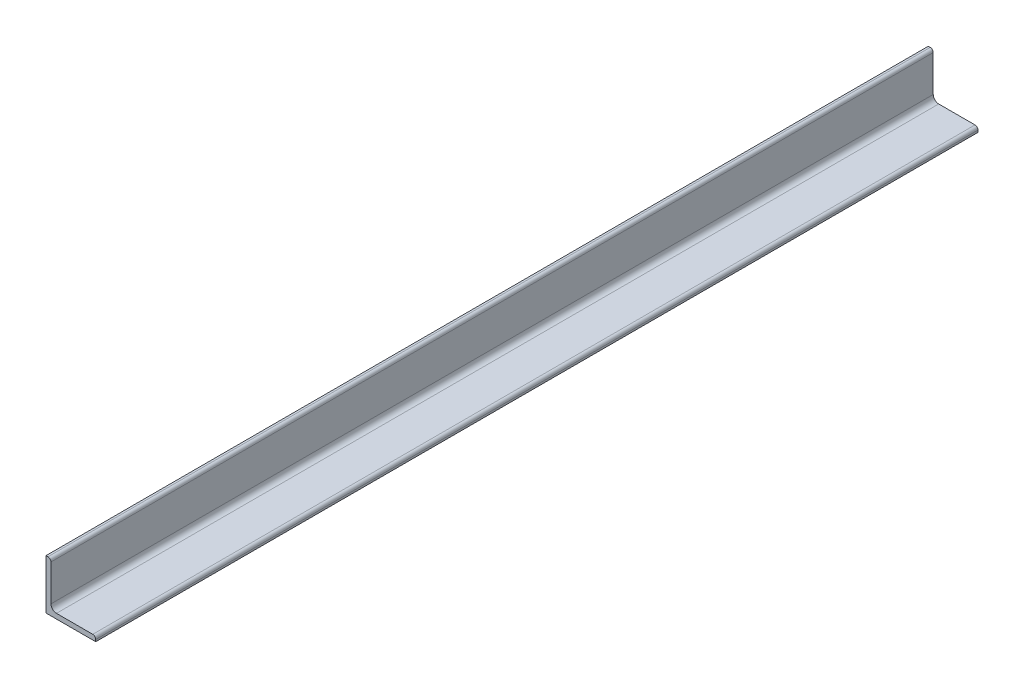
ISO-10303-21;
HEADER;
FILE_DESCRIPTION(('STEP AP214'),'2;1');
FILE_NAME('part.step','',(''),(''),'','','');
FILE_SCHEMA(('AUTOMOTIVE_DESIGN { 1 0 10303 214 1 1 1 1 }'));
ENDSEC;
DATA;
#1=APPLICATION_CONTEXT('core data for automotive mechanical design processes');
#2=APPLICATION_PROTOCOL_DEFINITION('international standard','automotive_design',2000,#1);
#3=PRODUCT_CONTEXT('',#1,'mechanical');
#4=PRODUCT('Part','Part','',(#3));
#5=PRODUCT_RELATED_PRODUCT_CATEGORY('part','',(#4));
#6=PRODUCT_DEFINITION_FORMATION('','',#4);
#7=PRODUCT_DEFINITION_CONTEXT('part definition',#1,'design');
#8=PRODUCT_DEFINITION('design','',#6,#7);
#9=PRODUCT_DEFINITION_SHAPE('','',#8);
#10=(LENGTH_UNIT() NAMED_UNIT(*) SI_UNIT(.MILLI.,.METRE.));
#11=(NAMED_UNIT(*) PLANE_ANGLE_UNIT() SI_UNIT($,.RADIAN.));
#12=(NAMED_UNIT(*) SI_UNIT($,.STERADIAN.) SOLID_ANGLE_UNIT());
#13=UNCERTAINTY_MEASURE_WITH_UNIT(LENGTH_MEASURE(1.E-05),#10,'distance_accuracy_value','');
#14=(GEOMETRIC_REPRESENTATION_CONTEXT(3) GLOBAL_UNCERTAINTY_ASSIGNED_CONTEXT((#13)) GLOBAL_UNIT_ASSIGNED_CONTEXT((#10,
#11,#12)) REPRESENTATION_CONTEXT('',''));
#15=CARTESIAN_POINT('',(0.,0.,0.));
#16=DIRECTION('',(0.,0.,1.));
#17=DIRECTION('',(1.,0.,0.));
#18=AXIS2_PLACEMENT_3D('',#15,#16,#17);
#19=CARTESIAN_POINT('',(1.99999999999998,50.,887.));
#20=DIRECTION('',(0.,-1.,0.));
#21=DIRECTION('',(0.,0.,-1.));
#22=AXIS2_PLACEMENT_3D('',#19,#20,#21);
#23=PLANE('',#22);
#24=DIRECTION('',(-1.,0.,0.));
#25=VECTOR('',#24,1.);
#26=CARTESIAN_POINT('',(1.99999999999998,50.,0.));
#27=LINE('',#26,#25);
#28=CARTESIAN_POINT('',(1.99999999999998,50.,0.));
#29=VERTEX_POINT('',#28);
#30=CARTESIAN_POINT('',(0.,50.,0.));
#31=VERTEX_POINT('',#30);
#32=EDGE_CURVE('E143',#29,#31,#27,.T.);
#33=ORIENTED_EDGE('',*,*,#32,.T.);
#34=DIRECTION('',(0.,0.,-1.));
#35=VECTOR('',#34,1.);
#36=CARTESIAN_POINT('',(0.,50.,887.));
#37=LINE('',#36,#35);
#38=CARTESIAN_POINT('',(0.,50.,887.));
#39=VERTEX_POINT('',#38);
#40=EDGE_CURVE('E11',#39,#31,#37,.T.);
#41=ORIENTED_EDGE('',*,*,#40,.F.);
#42=DIRECTION('',(-1.,0.,0.));
#43=VECTOR('',#42,1.);
#44=CARTESIAN_POINT('',(1.99999999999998,50.,887.));
#45=LINE('',#44,#43);
#46=CARTESIAN_POINT('',(1.99999999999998,50.,887.));
#47=VERTEX_POINT('',#46);
#48=EDGE_CURVE('E159',#47,#39,#45,.T.);
#49=ORIENTED_EDGE('',*,*,#48,.F.);
#50=DIRECTION('',(0.,0.,-1.));
#51=VECTOR('',#50,1.);
#52=CARTESIAN_POINT('',(1.99999999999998,50.,887.));
#53=LINE('',#52,#51);
#54=EDGE_CURVE('E139',#47,#29,#53,.T.);
#55=ORIENTED_EDGE('',*,*,#54,.T.);
#56=EDGE_LOOP('',(#33,#41,#49,#55));
#57=FACE_BOUND('',#56,.T.);
#58=ADVANCED_FACE('F41',(#57),#23,.F.);
#59=CARTESIAN_POINT('',(0.,50.,887.));
#60=DIRECTION('',(1.,0.,0.));
#61=DIRECTION('',(0.,1.,0.));
#62=AXIS2_PLACEMENT_3D('',#59,#60,#61);
#63=PLANE('',#62);
#64=DIRECTION('',(0.,-1.,0.));
#65=VECTOR('',#64,1.);
#66=CARTESIAN_POINT('',(0.,50.,0.));
#67=LINE('',#66,#65);
#68=CARTESIAN_POINT('',(0.,0.,0.));
#69=VERTEX_POINT('',#68);
#70=EDGE_CURVE('E146',#31,#69,#67,.T.);
#71=ORIENTED_EDGE('',*,*,#70,.T.);
#72=DIRECTION('',(0.,0.,-1.));
#73=VECTOR('',#72,1.);
#74=CARTESIAN_POINT('',(0.,0.,887.));
#75=LINE('',#74,#73);
#76=CARTESIAN_POINT('',(0.,0.,887.));
#77=VERTEX_POINT('',#76);
#78=EDGE_CURVE('E49',#77,#69,#75,.T.);
#79=ORIENTED_EDGE('',*,*,#78,.F.);
#80=DIRECTION('',(0.,-1.,0.));
#81=VECTOR('',#80,1.);
#82=CARTESIAN_POINT('',(0.,50.,887.));
#83=LINE('',#82,#81);
#84=EDGE_CURVE('E103',#39,#77,#83,.T.);
#85=ORIENTED_EDGE('',*,*,#84,.F.);
#86=ORIENTED_EDGE('',*,*,#40,.T.);
#87=EDGE_LOOP('',(#71,#79,#85,#86));
#88=FACE_BOUND('',#87,.T.);
#89=ADVANCED_FACE('F202',(#88),#63,.F.);
#90=CARTESIAN_POINT('',(0.,0.,887.));
#91=DIRECTION('',(0.,1.,0.));
#92=DIRECTION('',(0.,0.,1.));
#93=AXIS2_PLACEMENT_3D('',#90,#91,#92);
#94=PLANE('',#93);
#95=DIRECTION('',(1.,0.,0.));
#96=VECTOR('',#95,1.);
#97=CARTESIAN_POINT('',(0.,0.,0.));
#98=LINE('',#97,#96);
#99=CARTESIAN_POINT('',(50.,0.,0.));
#100=VERTEX_POINT('',#99);
#101=EDGE_CURVE('E148',#69,#100,#98,.T.);
#102=ORIENTED_EDGE('',*,*,#101,.T.);
#103=DIRECTION('',(0.,0.,-1.));
#104=VECTOR('',#103,1.);
#105=CARTESIAN_POINT('',(50.,0.,887.));
#106=LINE('',#105,#104);
#107=CARTESIAN_POINT('',(50.,0.,887.));
#108=VERTEX_POINT('',#107);
#109=EDGE_CURVE('E169',#108,#100,#106,.T.);
#110=ORIENTED_EDGE('',*,*,#109,.F.);
#111=DIRECTION('',(1.,0.,0.));
#112=VECTOR('',#111,1.);
#113=CARTESIAN_POINT('',(0.,0.,887.));
#114=LINE('',#113,#112);
#115=EDGE_CURVE('E177',#77,#108,#114,.T.);
#116=ORIENTED_EDGE('',*,*,#115,.F.);
#117=ORIENTED_EDGE('',*,*,#78,.T.);
#118=EDGE_LOOP('',(#102,#110,#116,#117));
#119=FACE_BOUND('',#118,.T.);
#120=ADVANCED_FACE('F175',(#119),#94,.F.);
#121=CARTESIAN_POINT('',(50.,0.,887.));
#122=DIRECTION('',(-1.,0.,0.));
#123=DIRECTION('',(0.,0.,1.));
#124=AXIS2_PLACEMENT_3D('',#121,#122,#123);
#125=PLANE('',#124);
#126=DIRECTION('',(0.,1.,0.));
#127=VECTOR('',#126,1.);
#128=CARTESIAN_POINT('',(50.,0.,0.));
#129=LINE('',#128,#127);
#130=CARTESIAN_POINT('',(50.,1.99999999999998,0.));
#131=VERTEX_POINT('',#130);
#132=EDGE_CURVE('E150',#100,#131,#129,.T.);
#133=ORIENTED_EDGE('',*,*,#132,.T.);
#134=DIRECTION('',(0.,0.,-1.));
#135=VECTOR('',#134,1.);
#136=CARTESIAN_POINT('',(50.,1.99999999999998,887.));
#137=LINE('',#136,#135);
#138=CARTESIAN_POINT('',(50.,1.99999999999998,887.));
#139=VERTEX_POINT('',#138);
#140=EDGE_CURVE('E166',#139,#131,#137,.T.);
#141=ORIENTED_EDGE('',*,*,#140,.F.);
#142=DIRECTION('',(0.,1.,0.));
#143=VECTOR('',#142,1.);
#144=CARTESIAN_POINT('',(50.,0.,887.));
#145=LINE('',#144,#143);
#146=EDGE_CURVE('E193',#108,#139,#145,.T.);
#147=ORIENTED_EDGE('',*,*,#146,.F.);
#148=ORIENTED_EDGE('',*,*,#109,.T.);
#149=EDGE_LOOP('',(#133,#141,#147,#148));
#150=FACE_BOUND('',#149,.T.);
#151=ADVANCED_FACE('F186',(#150),#125,.F.);
#152=CARTESIAN_POINT('',(47.,2.,887.));
#153=DIRECTION('',(0.,0.,-1.));
#154=DIRECTION('',(-1.,0.,0.));
#155=AXIS2_PLACEMENT_3D('',#152,#153,#154);
#156=CYLINDRICAL_SURFACE('',#155,3.);
#157=CARTESIAN_POINT('',(47.,2.,0.));
#158=DIRECTION('',(0.,0.,1.));
#159=DIRECTION('',(1.,0.,0.));
#160=AXIS2_PLACEMENT_3D('',#157,#158,#159);
#161=CIRCLE('',#160,3.);
#162=CARTESIAN_POINT('',(47.,5.,0.));
#163=VERTEX_POINT('',#162);
#164=EDGE_CURVE('E152',#131,#163,#161,.T.);
#165=ORIENTED_EDGE('',*,*,#164,.T.);
#166=DIRECTION('',(0.,0.,-1.));
#167=VECTOR('',#166,1.);
#168=CARTESIAN_POINT('',(47.,5.,887.));
#169=LINE('',#168,#167);
#170=CARTESIAN_POINT('',(47.,5.,887.));
#171=VERTEX_POINT('',#170);
#172=EDGE_CURVE('E163',#171,#163,#169,.T.);
#173=ORIENTED_EDGE('',*,*,#172,.F.);
#174=CARTESIAN_POINT('',(47.,2.,887.));
#175=DIRECTION('',(0.,0.,1.));
#176=DIRECTION('',(1.,0.,0.));
#177=AXIS2_PLACEMENT_3D('',#174,#175,#176);
#178=CIRCLE('',#177,3.);
#179=EDGE_CURVE('E192',#139,#171,#178,.T.);
#180=ORIENTED_EDGE('',*,*,#179,.F.);
#181=ORIENTED_EDGE('',*,*,#140,.T.);
#182=EDGE_LOOP('',(#165,#173,#180,#181));
#183=FACE_BOUND('',#182,.T.);
#184=ADVANCED_FACE('F190',(#183),#156,.T.);
#185=CARTESIAN_POINT('',(47.,5.,887.));
#186=DIRECTION('',(0.,-1.,0.));
#187=DIRECTION('',(1.,0.,0.));
#188=AXIS2_PLACEMENT_3D('',#185,#186,#187);
#189=PLANE('',#188);
#190=DIRECTION('',(-1.,0.,0.));
#191=VECTOR('',#190,1.);
#192=CARTESIAN_POINT('',(47.,5.,0.));
#193=LINE('',#192,#191);
#194=CARTESIAN_POINT('',(10.5,5.,0.));
#195=VERTEX_POINT('',#194);
#196=EDGE_CURVE('E154',#163,#195,#193,.T.);
#197=ORIENTED_EDGE('',*,*,#196,.T.);
#198=DIRECTION('',(0.,0.,-1.));
#199=VECTOR('',#198,1.);
#200=CARTESIAN_POINT('',(10.5,5.,887.));
#201=LINE('',#200,#199);
#202=CARTESIAN_POINT('',(10.5,5.,887.));
#203=VERTEX_POINT('',#202);
#204=EDGE_CURVE('E134',#203,#195,#201,.T.);
#205=ORIENTED_EDGE('',*,*,#204,.F.);
#206=DIRECTION('',(-1.,0.,0.));
#207=VECTOR('',#206,1.);
#208=CARTESIAN_POINT('',(47.,5.,887.));
#209=LINE('',#208,#207);
#210=EDGE_CURVE('E125',#171,#203,#209,.T.);
#211=ORIENTED_EDGE('',*,*,#210,.F.);
#212=ORIENTED_EDGE('',*,*,#172,.T.);
#213=EDGE_LOOP('',(#197,#205,#211,#212));
#214=FACE_BOUND('',#213,.T.);
#215=ADVANCED_FACE('F214',(#214),#189,.F.);
#216=CARTESIAN_POINT('',(10.5,10.5,887.));
#217=DIRECTION('',(0.,0.,-1.));
#218=DIRECTION('',(-1.,0.,0.));
#219=AXIS2_PLACEMENT_3D('',#216,#217,#218);
#220=CYLINDRICAL_SURFACE('',#219,5.5);
#221=CARTESIAN_POINT('',(10.5,10.5,0.));
#222=DIRECTION('',(0.,0.,-1.));
#223=DIRECTION('',(-1.,0.,0.));
#224=AXIS2_PLACEMENT_3D('',#221,#222,#223);
#225=CIRCLE('',#224,5.5);
#226=CARTESIAN_POINT('',(5.,10.5,0.));
#227=VERTEX_POINT('',#226);
#228=EDGE_CURVE('E133',#195,#227,#225,.T.);
#229=ORIENTED_EDGE('',*,*,#228,.T.);
#230=DIRECTION('',(0.,0.,-1.));
#231=VECTOR('',#230,1.);
#232=CARTESIAN_POINT('',(5.,10.5,887.));
#233=LINE('',#232,#231);
#234=CARTESIAN_POINT('',(5.,10.5,887.));
#235=VERTEX_POINT('',#234);
#236=EDGE_CURVE('E130',#235,#227,#233,.T.);
#237=ORIENTED_EDGE('',*,*,#236,.F.);
#238=CARTESIAN_POINT('',(10.5,10.5,887.));
#239=DIRECTION('',(0.,0.,-1.));
#240=DIRECTION('',(-1.,0.,0.));
#241=AXIS2_PLACEMENT_3D('',#238,#239,#240);
#242=CIRCLE('',#241,5.5);
#243=EDGE_CURVE('E119',#203,#235,#242,.T.);
#244=ORIENTED_EDGE('',*,*,#243,.F.);
#245=ORIENTED_EDGE('',*,*,#204,.T.);
#246=EDGE_LOOP('',(#229,#237,#244,#245));
#247=FACE_BOUND('',#246,.T.);
#248=ADVANCED_FACE('F131',(#247),#220,.F.);
#249=CARTESIAN_POINT('',(5.,10.5,887.));
#250=DIRECTION('',(-1.,0.,0.));
#251=DIRECTION('',(0.,-1.,0.));
#252=AXIS2_PLACEMENT_3D('',#249,#250,#251);
#253=PLANE('',#252);
#254=DIRECTION('',(0.,1.,0.));
#255=VECTOR('',#254,1.);
#256=CARTESIAN_POINT('',(5.,10.5,0.));
#257=LINE('',#256,#255);
#258=CARTESIAN_POINT('',(5.00000000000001,47.,0.));
#259=VERTEX_POINT('',#258);
#260=EDGE_CURVE('E89',#227,#259,#257,.T.);
#261=ORIENTED_EDGE('',*,*,#260,.T.);
#262=DIRECTION('',(0.,0.,-1.));
#263=VECTOR('',#262,1.);
#264=CARTESIAN_POINT('',(5.00000000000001,47.,887.));
#265=LINE('',#264,#263);
#266=CARTESIAN_POINT('',(5.00000000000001,47.,887.));
#267=VERTEX_POINT('',#266);
#268=EDGE_CURVE('E135',#267,#259,#265,.T.);
#269=ORIENTED_EDGE('',*,*,#268,.F.);
#270=DIRECTION('',(0.,1.,0.));
#271=VECTOR('',#270,1.);
#272=CARTESIAN_POINT('',(5.,10.5,887.));
#273=LINE('',#272,#271);
#274=EDGE_CURVE('E123',#235,#267,#273,.T.);
#275=ORIENTED_EDGE('',*,*,#274,.F.);
#276=ORIENTED_EDGE('',*,*,#236,.T.);
#277=EDGE_LOOP('',(#261,#269,#275,#276));
#278=FACE_BOUND('',#277,.T.);
#279=ADVANCED_FACE('F137',(#278),#253,.F.);
#280=CARTESIAN_POINT('',(2.00000000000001,47.,887.));
#281=DIRECTION('',(0.,0.,-1.));
#282=DIRECTION('',(-1.,0.,0.));
#283=AXIS2_PLACEMENT_3D('',#280,#281,#282);
#284=CYLINDRICAL_SURFACE('',#283,3.);
#285=CARTESIAN_POINT('',(2.00000000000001,47.,0.));
#286=DIRECTION('',(0.,0.,1.));
#287=DIRECTION('',(1.,0.,0.));
#288=AXIS2_PLACEMENT_3D('',#285,#286,#287);
#289=CIRCLE('',#288,3.);
#290=EDGE_CURVE('E95',#259,#29,#289,.T.);
#291=ORIENTED_EDGE('',*,*,#290,.T.);
#292=ORIENTED_EDGE('',*,*,#54,.F.);
#293=CARTESIAN_POINT('',(2.00000000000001,47.,887.));
#294=DIRECTION('',(0.,0.,1.));
#295=DIRECTION('',(1.,0.,0.));
#296=AXIS2_PLACEMENT_3D('',#293,#294,#295);
#297=CIRCLE('',#296,3.);
#298=EDGE_CURVE('E57',#267,#47,#297,.T.);
#299=ORIENTED_EDGE('',*,*,#298,.F.);
#300=ORIENTED_EDGE('',*,*,#268,.T.);
#301=EDGE_LOOP('',(#291,#292,#299,#300));
#302=FACE_BOUND('',#301,.T.);
#303=ADVANCED_FACE('F222',(#302),#284,.T.);
#304=CARTESIAN_POINT('',(47.,2.,887.));
#305=DIRECTION('',(0.,0.,1.));
#306=DIRECTION('',(1.,0.,0.));
#307=AXIS2_PLACEMENT_3D('',#304,#305,#306);
#308=PLANE('',#307);
#309=ORIENTED_EDGE('',*,*,#48,.T.);
#310=ORIENTED_EDGE('',*,*,#84,.T.);
#311=ORIENTED_EDGE('',*,*,#115,.T.);
#312=ORIENTED_EDGE('',*,*,#146,.T.);
#313=ORIENTED_EDGE('',*,*,#179,.T.);
#314=ORIENTED_EDGE('',*,*,#210,.T.);
#315=ORIENTED_EDGE('',*,*,#243,.T.);
#316=ORIENTED_EDGE('',*,*,#274,.T.);
#317=ORIENTED_EDGE('',*,*,#298,.T.);
#318=EDGE_LOOP('',(#309,#310,#311,#312,#313,#314,#315,#316,#317));
#319=FACE_BOUND('',#318,.T.);
#320=ADVANCED_FACE('F121',(#319),#308,.T.);
#321=CARTESIAN_POINT('',(47.,2.,0.));
#322=DIRECTION('',(0.,0.,1.));
#323=DIRECTION('',(1.,0.,0.));
#324=AXIS2_PLACEMENT_3D('',#321,#322,#323);
#325=PLANE('',#324);
#326=ORIENTED_EDGE('',*,*,#32,.F.);
#327=ORIENTED_EDGE('',*,*,#290,.F.);
#328=ORIENTED_EDGE('',*,*,#260,.F.);
#329=ORIENTED_EDGE('',*,*,#228,.F.);
#330=ORIENTED_EDGE('',*,*,#196,.F.);
#331=ORIENTED_EDGE('',*,*,#164,.F.);
#332=ORIENTED_EDGE('',*,*,#132,.F.);
#333=ORIENTED_EDGE('',*,*,#101,.F.);
#334=ORIENTED_EDGE('',*,*,#70,.F.);
#335=EDGE_LOOP('',(#326,#327,#328,#329,#330,#331,#332,#333,#334));
#336=FACE_BOUND('',#335,.T.);
#337=ADVANCED_FACE('F181',(#336),#325,.F.);
#338=CLOSED_SHELL('',(#58,#89,#120,#151,#184,#215,#248,#279,#303,#320,#337));
#339=MANIFOLD_SOLID_BREP('B2',#338);
#340=ADVANCED_BREP_SHAPE_REPRESENTATION('',(#18,#339),#14);
#341=SHAPE_DEFINITION_REPRESENTATION(#9,#340);
ENDSEC;
END-ISO-10303-21;
